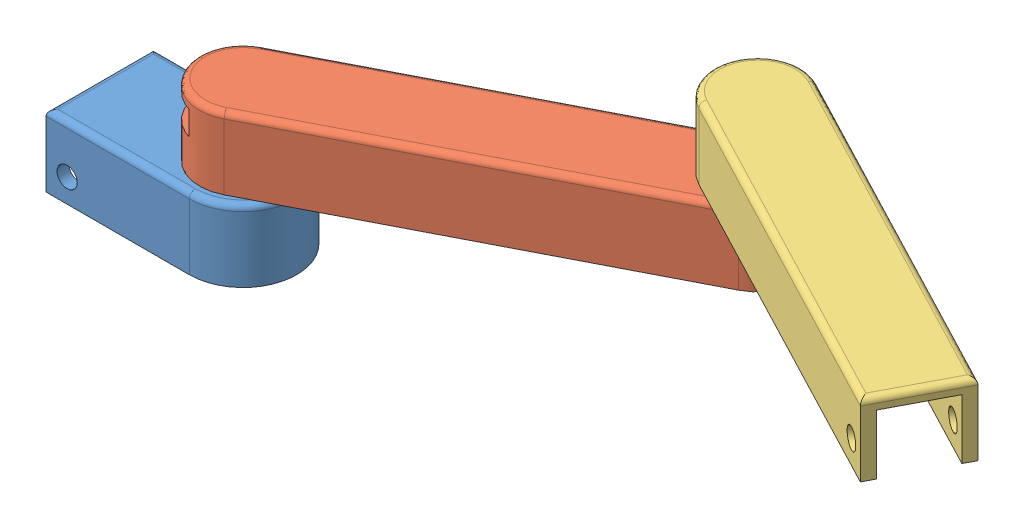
SolidWorks assembly LeverLinkage.SLDASM, configuration Default (file format 3693). Lengths in mm.
Overall size (895.46 228.6 310.79).
3 component instances, 3 part files, 4 mates.
Components (placement in the parent):
- Swing-Arm-Holder-1: Swing-Arm-Holder.SLDPRT [Default] at origin size (209.55 127 114.3)
- Lever-Arm-1: Lever-Arm.SLDPRT [Default] at (354.3108 76.2 -108.8323) x (0.889351 0 -0.457225) z (0.457225 0 0.889351) size (499.11 95.25 92.71)
- Dual - Lever-Arm-1: Dual - Lever-Arm.SLDPRT [Default] at (895.464 152.4 -95.7696) x (-0.886212 0 -0.46328) z (0.46328 0 -0.886212) size (452.75 76.2 92.71)
Mates (geometry in assembly coordinates):
- Concentric1: concentric aligned: cylinder of Swing-Arm-Holder-1; cylinder of Lever-Arm-1
- Coincident1: coincident anti-aligned: plane of Swing-Arm-Holder-1 through (152.4 76.2 -57.15) normal (0 1 0); plane of Lever-Arm-1 through (513.8322 76.2 -242.9663) normal (0 -1 0)
- Concentric2: concentric aligned: cylinder of Lever-Arm-1; cylinder of Dual - Lever-Arm-1
- Coincident2: coincident anti-aligned: plane of Lever-Arm-1 through (513.8322 152.4 -242.9663) normal (0 1 0); plane of Dual - Lever-Arm-1 through (513.8322 152.4 -242.9663) normal (0 -1 0)
